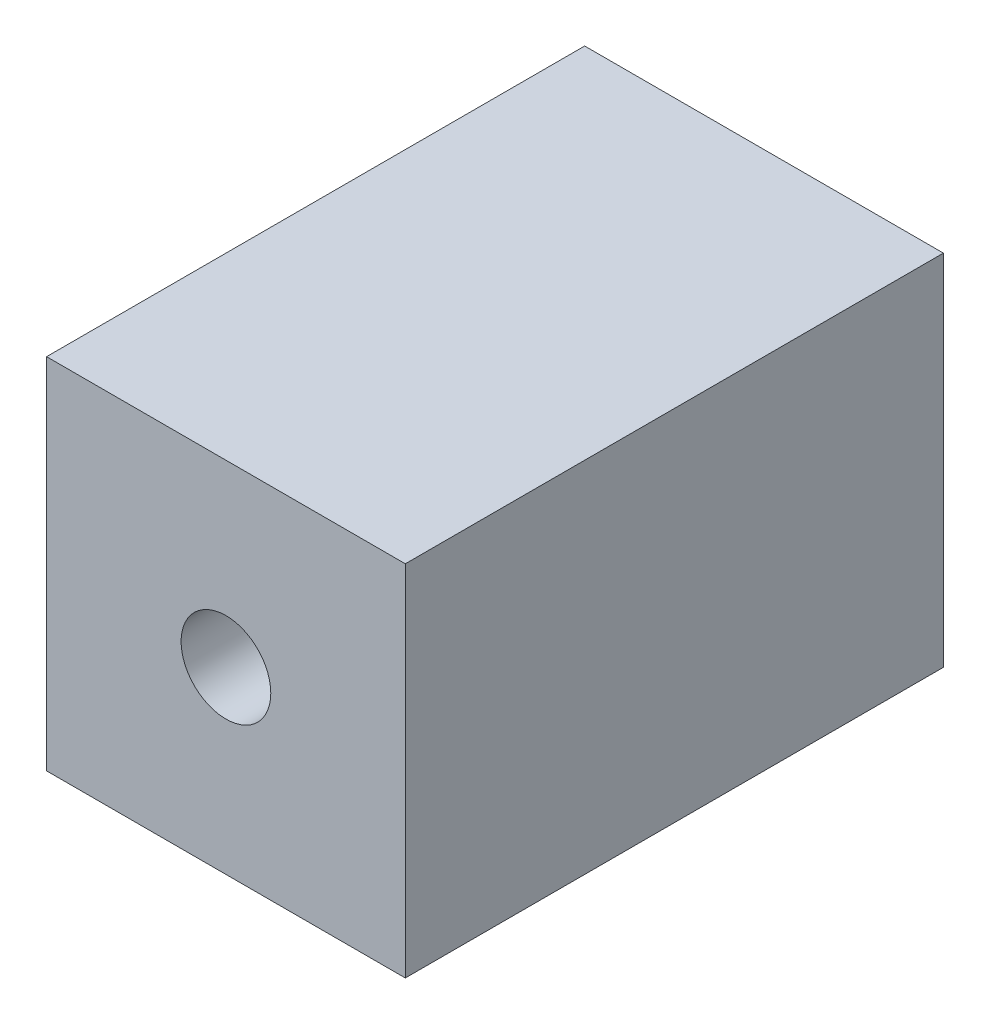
from build123d import *

# Parameters (mm, degrees)
SKETCH1_W           = 20
SKETCH1_H           = 20
BOSS_EXTRUDE1_DEPTH = 30
SKETCH2_R           = 2.5
CUT_EXTRUDE1_DEPTH  = 5


with BuildPart() as part:
    # Sketch1 → Boss-Extrude1 (new body)
    with BuildSketch(Plane.XY):
        with Locations((10, -10)):
            Rectangle(SKETCH1_W, SKETCH1_H)
    extrude(amount=BOSS_EXTRUDE1_DEPTH)

    # Sketch2 → Cut-Extrude1 (cut)
    with BuildSketch(Plane.XY.offset(30)):
        with Locations((10, -10)):
            Circle(SKETCH2_R)
    extrude(amount=-CUT_EXTRUDE1_DEPTH, mode=Mode.SUBTRACT)


solid = part.part
